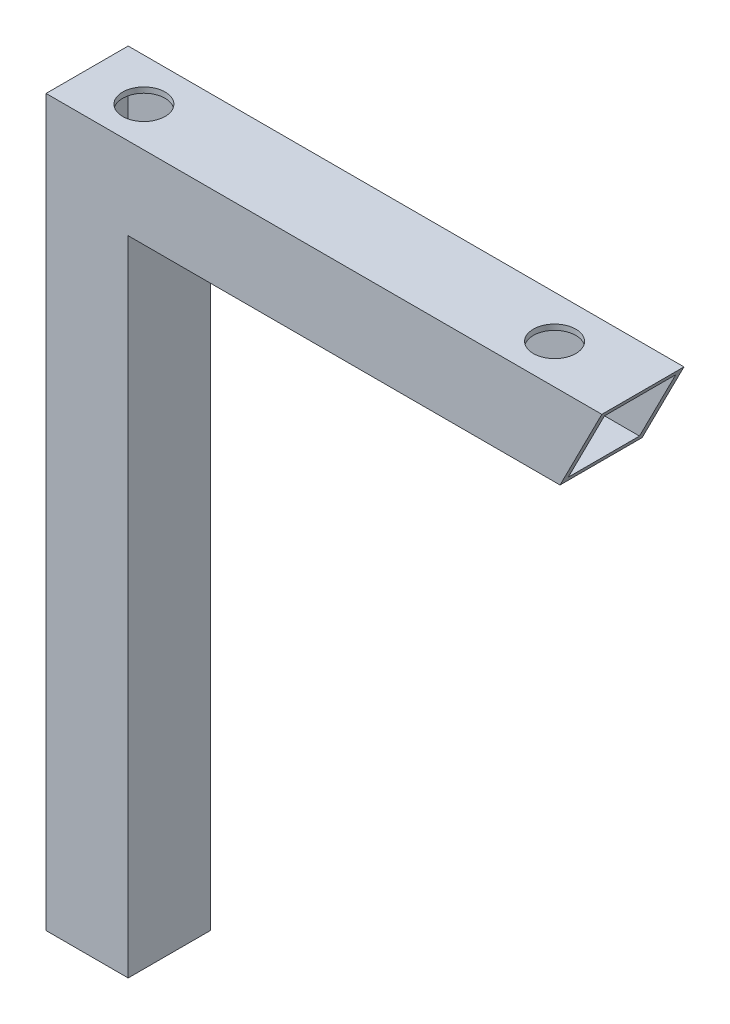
ISO-10303-21;
HEADER;
FILE_DESCRIPTION(('STEP AP214'),'2;1');
FILE_NAME('part.step','',(''),(''),'','','');
FILE_SCHEMA(('AUTOMOTIVE_DESIGN { 1 0 10303 214 1 1 1 1 }'));
ENDSEC;
DATA;
#1=APPLICATION_CONTEXT('core data for automotive mechanical design processes');
#2=APPLICATION_PROTOCOL_DEFINITION('international standard','automotive_design',2000,#1);
#3=PRODUCT_CONTEXT('',#1,'mechanical');
#4=PRODUCT('Part','Part','',(#3));
#5=PRODUCT_RELATED_PRODUCT_CATEGORY('part','',(#4));
#6=PRODUCT_DEFINITION_FORMATION('','',#4);
#7=PRODUCT_DEFINITION_CONTEXT('part definition',#1,'design');
#8=PRODUCT_DEFINITION('design','',#6,#7);
#9=PRODUCT_DEFINITION_SHAPE('','',#8);
#10=(LENGTH_UNIT() NAMED_UNIT(*) SI_UNIT(.MILLI.,.METRE.));
#11=(NAMED_UNIT(*) PLANE_ANGLE_UNIT() SI_UNIT($,.RADIAN.));
#12=(NAMED_UNIT(*) SI_UNIT($,.STERADIAN.) SOLID_ANGLE_UNIT());
#13=UNCERTAINTY_MEASURE_WITH_UNIT(LENGTH_MEASURE(1.E-05),#10,'distance_accuracy_value','');
#14=(GEOMETRIC_REPRESENTATION_CONTEXT(3) GLOBAL_UNCERTAINTY_ASSIGNED_CONTEXT((#13)) GLOBAL_UNIT_ASSIGNED_CONTEXT((#10,
#11,#12)) REPRESENTATION_CONTEXT('',''));
#15=CARTESIAN_POINT('',(0.,0.,0.));
#16=DIRECTION('',(0.,0.,1.));
#17=DIRECTION('',(1.,0.,0.));
#18=AXIS2_PLACEMENT_3D('',#15,#16,#17);
#19=CARTESIAN_POINT('',(12.7792611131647,-143.515804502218,30.));
#20=DIRECTION('',(-1.,0.,0.));
#21=DIRECTION('',(0.,0.,1.));
#22=AXIS2_PLACEMENT_3D('',#19,#20,#21);
#23=PLANE('',#22);
#24=DIRECTION('',(0.,1.,0.));
#25=VECTOR('',#24,1.);
#26=CARTESIAN_POINT('',(12.7792611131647,121.284195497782,19.4212184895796));
#27=LINE('',#26,#25);
#28=CARTESIAN_POINT('',(12.7792611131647,-143.515804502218,19.4212184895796));
#29=VERTEX_POINT('',#28);
#30=CARTESIAN_POINT('',(12.7792611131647,93.2841954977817,19.4212184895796));
#31=VERTEX_POINT('',#30);
#32=EDGE_CURVE('E56',#29,#31,#27,.T.);
#33=ORIENTED_EDGE('',*,*,#32,.F.);
#34=DIRECTION('',(0.,0.,1.));
#35=VECTOR('',#34,1.);
#36=CARTESIAN_POINT('',(12.7792611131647,-143.515804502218,28.));
#37=LINE('',#36,#35);
#38=CARTESIAN_POINT('',(12.7792611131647,-143.515804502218,28.));
#39=VERTEX_POINT('',#38);
#40=EDGE_CURVE('E63',#29,#39,#37,.T.);
#41=ORIENTED_EDGE('',*,*,#40,.T.);
#42=DIRECTION('',(0.,1.,0.));
#43=VECTOR('',#42,1.);
#44=CARTESIAN_POINT('',(12.7792611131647,-143.515804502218,28.));
#45=LINE('',#44,#43);
#46=CARTESIAN_POINT('',(12.7792611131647,93.2841954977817,28.));
#47=VERTEX_POINT('',#46);
#48=EDGE_CURVE('E177',#39,#47,#45,.T.);
#49=ORIENTED_EDGE('',*,*,#48,.T.);
#50=DIRECTION('',(0.,0.,-1.));
#51=VECTOR('',#50,1.);
#52=CARTESIAN_POINT('',(12.7792611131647,93.2841954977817,30.));
#53=LINE('',#52,#51);
#54=EDGE_CURVE('E151',#47,#31,#53,.T.);
#55=ORIENTED_EDGE('',*,*,#54,.T.);
#56=EDGE_LOOP('',(#33,#41,#49,#55));
#57=FACE_BOUND('',#56,.T.);
#58=ADVANCED_FACE('F41',(#57),#23,.T.);
#59=CARTESIAN_POINT('',(172.513278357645,91.2841954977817,30.));
#60=DIRECTION('',(-0.891244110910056,0.453523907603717,0.));
#61=DIRECTION('',(-0.453523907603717,-0.891244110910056,0.));
#62=AXIS2_PLACEMENT_3D('',#59,#60,#61);
#63=PLANE('',#62);
#64=DIRECTION('',(0.453523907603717,0.891244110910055,0.));
#65=VECTOR('',#64,1.);
#66=CARTESIAN_POINT('',(172.513278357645,91.2841954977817,0.));
#67=LINE('',#66,#65);
#68=CARTESIAN_POINT('',(172.513278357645,91.2841954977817,0.));
#69=VERTEX_POINT('',#68);
#70=CARTESIAN_POINT('',(187.779261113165,121.284195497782,0.));
#71=VERTEX_POINT('',#70);
#72=EDGE_CURVE('E230',#69,#71,#67,.T.);
#73=ORIENTED_EDGE('',*,*,#72,.T.);
#74=DIRECTION('',(0.,0.,-1.));
#75=VECTOR('',#74,1.);
#76=CARTESIAN_POINT('',(187.779261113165,121.284195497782,30.));
#77=LINE('',#76,#75);
#78=CARTESIAN_POINT('',(187.779261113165,121.284195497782,30.));
#79=VERTEX_POINT('',#78);
#80=EDGE_CURVE('E235',#79,#71,#77,.T.);
#81=ORIENTED_EDGE('',*,*,#80,.F.);
#82=DIRECTION('',(0.453523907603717,0.891244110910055,0.));
#83=VECTOR('',#82,1.);
#84=CARTESIAN_POINT('',(172.513278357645,91.2841954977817,30.));
#85=LINE('',#84,#83);
#86=CARTESIAN_POINT('',(172.513278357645,91.2841954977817,30.));
#87=VERTEX_POINT('',#86);
#88=EDGE_CURVE('E217',#87,#79,#85,.T.);
#89=ORIENTED_EDGE('',*,*,#88,.F.);
#90=DIRECTION('',(0.,0.,-1.));
#91=VECTOR('',#90,1.);
#92=CARTESIAN_POINT('',(172.513278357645,91.2841954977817,30.));
#93=LINE('',#92,#91);
#94=EDGE_CURVE('E238',#87,#69,#93,.T.);
#95=ORIENTED_EDGE('',*,*,#94,.T.);
#96=EDGE_LOOP('',(#73,#81,#89,#95));
#97=FACE_BOUND('',#96,.T.);
#98=DIRECTION('',(0.453523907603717,0.891244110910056,0.));
#99=VECTOR('',#98,1.);
#100=CARTESIAN_POINT('',(172.513278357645,91.2841954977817,2.));
#101=LINE('',#100,#99);
#102=CARTESIAN_POINT('',(173.531010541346,93.2841954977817,2.));
#103=VERTEX_POINT('',#102);
#104=CARTESIAN_POINT('',(186.761528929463,119.284195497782,2.));
#105=VERTEX_POINT('',#104);
#106=EDGE_CURVE('E193',#103,#105,#101,.T.);
#107=ORIENTED_EDGE('',*,*,#106,.F.);
#108=DIRECTION('',(0.,0.,-1.));
#109=VECTOR('',#108,1.);
#110=CARTESIAN_POINT('',(173.531010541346,93.2841954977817,30.));
#111=LINE('',#110,#109);
#112=CARTESIAN_POINT('',(173.531010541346,93.2841954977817,28.));
#113=VERTEX_POINT('',#112);
#114=EDGE_CURVE('E199',#113,#103,#111,.T.);
#115=ORIENTED_EDGE('',*,*,#114,.F.);
#116=DIRECTION('',(0.453523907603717,0.891244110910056,0.));
#117=VECTOR('',#116,1.);
#118=CARTESIAN_POINT('',(172.513278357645,91.2841954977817,28.));
#119=LINE('',#118,#117);
#120=CARTESIAN_POINT('',(186.761528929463,119.284195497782,28.));
#121=VERTEX_POINT('',#120);
#122=EDGE_CURVE('E196',#113,#121,#119,.T.);
#123=ORIENTED_EDGE('',*,*,#122,.T.);
#124=DIRECTION('',(0.,0.,-1.));
#125=VECTOR('',#124,1.);
#126=CARTESIAN_POINT('',(186.761528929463,119.284195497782,30.));
#127=LINE('',#126,#125);
#128=EDGE_CURVE('E182',#121,#105,#127,.T.);
#129=ORIENTED_EDGE('',*,*,#128,.T.);
#130=EDGE_LOOP('',(#107,#115,#123,#129));
#131=FACE_BOUND('',#130,.T.);
#132=ADVANCED_FACE('F276',(#97,#131),#63,.F.);
#133=CARTESIAN_POINT('',(-15.2207388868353,-143.515804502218,30.));
#134=DIRECTION('',(1.,0.,0.));
#135=DIRECTION('',(0.,1.,0.));
#136=AXIS2_PLACEMENT_3D('',#133,#134,#135);
#137=PLANE('',#136);
#138=DIRECTION('',(0.,-1.,0.));
#139=VECTOR('',#138,1.);
#140=CARTESIAN_POINT('',(-15.2207388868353,-143.515804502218,0.));
#141=LINE('',#140,#139);
#142=CARTESIAN_POINT('',(-15.2207388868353,121.284195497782,0.));
#143=VERTEX_POINT('',#142);
#144=CARTESIAN_POINT('',(-15.2207388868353,-143.515804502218,0.));
#145=VERTEX_POINT('',#144);
#146=EDGE_CURVE('E188',#143,#145,#141,.T.);
#147=ORIENTED_EDGE('',*,*,#146,.T.);
#148=DIRECTION('',(0.,0.,-1.));
#149=VECTOR('',#148,1.);
#150=CARTESIAN_POINT('',(-15.2207388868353,-143.515804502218,30.));
#151=LINE('',#150,#149);
#152=CARTESIAN_POINT('',(-15.2207388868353,-143.515804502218,30.));
#153=VERTEX_POINT('',#152);
#154=EDGE_CURVE('E50',#153,#145,#151,.T.);
#155=ORIENTED_EDGE('',*,*,#154,.F.);
#156=DIRECTION('',(0.,-1.,0.));
#157=VECTOR('',#156,1.);
#158=CARTESIAN_POINT('',(-15.2207388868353,-143.515804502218,30.));
#159=LINE('',#158,#157);
#160=CARTESIAN_POINT('',(-15.2207388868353,121.284195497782,30.));
#161=VERTEX_POINT('',#160);
#162=EDGE_CURVE('E207',#161,#153,#159,.T.);
#163=ORIENTED_EDGE('',*,*,#162,.F.);
#164=DIRECTION('',(0.,0.,-1.));
#165=VECTOR('',#164,1.);
#166=CARTESIAN_POINT('',(-15.2207388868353,121.284195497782,30.));
#167=LINE('',#166,#165);
#168=EDGE_CURVE('E221',#161,#143,#167,.T.);
#169=ORIENTED_EDGE('',*,*,#168,.T.);
#170=EDGE_LOOP('',(#147,#155,#163,#169));
#171=FACE_BOUND('',#170,.T.);
#172=ADVANCED_FACE('F43',(#171),#137,.F.);
#173=CARTESIAN_POINT('',(14.7792611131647,-143.515804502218,30.));
#174=DIRECTION('',(0.,1.,0.));
#175=DIRECTION('',(-1.,0.,0.));
#176=AXIS2_PLACEMENT_3D('',#173,#174,#175);
#177=PLANE('',#176);
#178=ORIENTED_EDGE('',*,*,#40,.F.);
#179=CARTESIAN_POINT('',(6.06926111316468,-143.515804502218,15.5432808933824));
#180=DIRECTION('',(0.,1.,0.));
#181=DIRECTION('',(0.,0.,1.));
#182=AXIS2_PLACEMENT_3D('',#179,#180,#181);
#183=CIRCLE('',#182,7.74999999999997);
#184=CARTESIAN_POINT('',(12.7792611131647,-143.515804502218,11.6653432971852));
#185=VERTEX_POINT('',#184);
#186=EDGE_CURVE('E140',#29,#185,#183,.T.);
#187=ORIENTED_EDGE('',*,*,#186,.T.);
#188=CARTESIAN_POINT('',(12.7792611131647,-143.515804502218,2.));
#189=VERTEX_POINT('',#188);
#190=EDGE_CURVE('E160',#189,#185,#37,.T.);
#191=ORIENTED_EDGE('',*,*,#190,.F.);
#192=DIRECTION('',(1.,0.,0.));
#193=VECTOR('',#192,1.);
#194=CARTESIAN_POINT('',(12.7792611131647,-143.515804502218,2.));
#195=LINE('',#194,#193);
#196=CARTESIAN_POINT('',(-13.2207388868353,-143.515804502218,1.99999999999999));
#197=VERTEX_POINT('',#196);
#198=EDGE_CURVE('E169',#197,#189,#195,.T.);
#199=ORIENTED_EDGE('',*,*,#198,.F.);
#200=DIRECTION('',(0.,0.,-1.));
#201=VECTOR('',#200,1.);
#202=CARTESIAN_POINT('',(-13.2207388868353,-143.515804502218,28.));
#203=LINE('',#202,#201);
#204=CARTESIAN_POINT('',(-13.2207388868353,-143.515804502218,28.));
#205=VERTEX_POINT('',#204);
#206=EDGE_CURVE('E166',#205,#197,#203,.T.);
#207=ORIENTED_EDGE('',*,*,#206,.F.);
#208=DIRECTION('',(-1.,0.,0.));
#209=VECTOR('',#208,1.);
#210=CARTESIAN_POINT('',(12.7792611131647,-143.515804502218,28.));
#211=LINE('',#210,#209);
#212=EDGE_CURVE('E159',#39,#205,#211,.T.);
#213=ORIENTED_EDGE('',*,*,#212,.F.);
#214=EDGE_LOOP('',(#178,#187,#191,#199,#207,#213));
#215=FACE_BOUND('',#214,.T.);
#216=DIRECTION('',(1.,0.,0.));
#217=VECTOR('',#216,1.);
#218=CARTESIAN_POINT('',(14.7792611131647,-143.515804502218,0.));
#219=LINE('',#218,#217);
#220=CARTESIAN_POINT('',(14.7792611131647,-143.515804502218,0.));
#221=VERTEX_POINT('',#220);
#222=EDGE_CURVE('E224',#145,#221,#219,.T.);
#223=ORIENTED_EDGE('',*,*,#222,.T.);
#224=DIRECTION('',(0.,0.,-1.));
#225=VECTOR('',#224,1.);
#226=CARTESIAN_POINT('',(14.7792611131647,-143.515804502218,30.));
#227=LINE('',#226,#225);
#228=CARTESIAN_POINT('',(14.7792611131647,-143.515804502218,30.));
#229=VERTEX_POINT('',#228);
#230=EDGE_CURVE('E244',#229,#221,#227,.T.);
#231=ORIENTED_EDGE('',*,*,#230,.F.);
#232=DIRECTION('',(1.,0.,0.));
#233=VECTOR('',#232,1.);
#234=CARTESIAN_POINT('',(14.7792611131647,-143.515804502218,30.));
#235=LINE('',#234,#233);
#236=EDGE_CURVE('E210',#153,#229,#235,.T.);
#237=ORIENTED_EDGE('',*,*,#236,.F.);
#238=ORIENTED_EDGE('',*,*,#154,.T.);
#239=EDGE_LOOP('',(#223,#231,#237,#238));
#240=FACE_BOUND('',#239,.T.);
#241=ADVANCED_FACE('F155',(#215,#240),#177,.F.);
#242=CARTESIAN_POINT('',(14.7792611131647,-143.515804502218,30.));
#243=DIRECTION('',(-1.,0.,0.));
#244=DIRECTION('',(0.,0.,1.));
#245=AXIS2_PLACEMENT_3D('',#242,#243,#244);
#246=PLANE('',#245);
#247=DIRECTION('',(0.,1.,0.));
#248=VECTOR('',#247,1.);
#249=CARTESIAN_POINT('',(14.7792611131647,-143.515804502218,0.));
#250=LINE('',#249,#248);
#251=CARTESIAN_POINT('',(14.7792611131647,91.2841954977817,0.));
#252=VERTEX_POINT('',#251);
#253=EDGE_CURVE('E226',#221,#252,#250,.T.);
#254=ORIENTED_EDGE('',*,*,#253,.T.);
#255=DIRECTION('',(0.,0.,-1.));
#256=VECTOR('',#255,1.);
#257=CARTESIAN_POINT('',(14.7792611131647,91.2841954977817,30.));
#258=LINE('',#257,#256);
#259=CARTESIAN_POINT('',(14.7792611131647,91.2841954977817,30.));
#260=VERTEX_POINT('',#259);
#261=EDGE_CURVE('E241',#260,#252,#258,.T.);
#262=ORIENTED_EDGE('',*,*,#261,.F.);
#263=DIRECTION('',(0.,1.,0.));
#264=VECTOR('',#263,1.);
#265=CARTESIAN_POINT('',(14.7792611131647,-143.515804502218,30.));
#266=LINE('',#265,#264);
#267=EDGE_CURVE('E213',#229,#260,#266,.T.);
#268=ORIENTED_EDGE('',*,*,#267,.F.);
#269=ORIENTED_EDGE('',*,*,#230,.T.);
#270=EDGE_LOOP('',(#254,#262,#268,#269));
#271=FACE_BOUND('',#270,.T.);
#272=ADVANCED_FACE('F262',(#271),#246,.F.);
#273=CARTESIAN_POINT('',(14.7792611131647,91.2841954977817,30.));
#274=DIRECTION('',(0.,1.,0.));
#275=DIRECTION('',(-1.,0.,0.));
#276=AXIS2_PLACEMENT_3D('',#273,#274,#275);
#277=PLANE('',#276);
#278=CARTESIAN_POINT('',(156.069261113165,91.2841954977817,15.5432808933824));
#279=DIRECTION('',(0.,1.,0.));
#280=DIRECTION('',(-1.,0.,0.));
#281=AXIS2_PLACEMENT_3D('',#278,#279,#280);
#282=CIRCLE('',#281,7.74999999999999);
#283=CARTESIAN_POINT('',(156.069261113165,91.2841954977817,23.2932808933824));
#284=VERTEX_POINT('',#283);
#285=EDGE_CURVE('E354',#284,#284,#282,.T.);
#286=ORIENTED_EDGE('',*,*,#285,.T.);
#287=EDGE_LOOP('',(#286));
#288=FACE_BOUND('',#287,.T.);
#289=DIRECTION('',(1.,0.,0.));
#290=VECTOR('',#289,1.);
#291=CARTESIAN_POINT('',(14.7792611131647,91.2841954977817,0.));
#292=LINE('',#291,#290);
#293=EDGE_CURVE('E228',#252,#69,#292,.T.);
#294=ORIENTED_EDGE('',*,*,#293,.T.);
#295=ORIENTED_EDGE('',*,*,#94,.F.);
#296=DIRECTION('',(1.,0.,0.));
#297=VECTOR('',#296,1.);
#298=CARTESIAN_POINT('',(14.7792611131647,91.2841954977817,30.));
#299=LINE('',#298,#297);
#300=EDGE_CURVE('E215',#260,#87,#299,.T.);
#301=ORIENTED_EDGE('',*,*,#300,.F.);
#302=ORIENTED_EDGE('',*,*,#261,.T.);
#303=EDGE_LOOP('',(#294,#295,#301,#302));
#304=FACE_BOUND('',#303,.T.);
#305=ADVANCED_FACE('F266',(#288,#304),#277,.F.);
#306=CARTESIAN_POINT('',(187.779261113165,121.284195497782,30.));
#307=DIRECTION('',(0.,-1.,0.));
#308=DIRECTION('',(1.,0.,0.));
#309=AXIS2_PLACEMENT_3D('',#306,#307,#308);
#310=PLANE('',#309);
#311=CARTESIAN_POINT('',(156.069261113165,121.284195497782,15.5432808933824));
#312=DIRECTION('',(0.,1.,0.));
#313=DIRECTION('',(0.,0.,1.));
#314=AXIS2_PLACEMENT_3D('',#311,#312,#313);
#315=CIRCLE('',#314,7.75000000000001);
#316=CARTESIAN_POINT('',(156.069261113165,121.284195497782,23.2932808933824));
#317=VERTEX_POINT('',#316);
#318=EDGE_CURVE('E347',#317,#317,#315,.T.);
#319=ORIENTED_EDGE('',*,*,#318,.F.);
#320=EDGE_LOOP('',(#319));
#321=FACE_BOUND('',#320,.T.);
#322=CARTESIAN_POINT('',(6.06926111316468,121.284195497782,15.5432808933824));
#323=DIRECTION('',(0.,1.,0.));
#324=DIRECTION('',(0.,0.,1.));
#325=AXIS2_PLACEMENT_3D('',#322,#323,#324);
#326=CIRCLE('',#325,7.75);
#327=CARTESIAN_POINT('',(6.06926111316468,121.284195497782,23.2932808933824));
#328=VERTEX_POINT('',#327);
#329=EDGE_CURVE('E147',#328,#328,#326,.T.);
#330=ORIENTED_EDGE('',*,*,#329,.F.);
#331=EDGE_LOOP('',(#330));
#332=FACE_BOUND('',#331,.T.);
#333=DIRECTION('',(-1.,0.,0.));
#334=VECTOR('',#333,1.);
#335=CARTESIAN_POINT('',(187.779261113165,121.284195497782,0.));
#336=LINE('',#335,#334);
#337=EDGE_CURVE('E211',#71,#143,#336,.T.);
#338=ORIENTED_EDGE('',*,*,#337,.T.);
#339=ORIENTED_EDGE('',*,*,#168,.F.);
#340=DIRECTION('',(-1.,0.,0.));
#341=VECTOR('',#340,1.);
#342=CARTESIAN_POINT('',(187.779261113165,121.284195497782,30.));
#343=LINE('',#342,#341);
#344=EDGE_CURVE('E219',#79,#161,#343,.T.);
#345=ORIENTED_EDGE('',*,*,#344,.F.);
#346=ORIENTED_EDGE('',*,*,#80,.T.);
#347=EDGE_LOOP('',(#338,#339,#345,#346));
#348=FACE_BOUND('',#347,.T.);
#349=ADVANCED_FACE('F274',(#321,#332,#348),#310,.F.);
#350=CARTESIAN_POINT('',(0.,0.,30.));
#351=DIRECTION('',(0.,0.,1.));
#352=DIRECTION('',(1.,0.,0.));
#353=AXIS2_PLACEMENT_3D('',#350,#351,#352);
#354=PLANE('',#353);
#355=ORIENTED_EDGE('',*,*,#162,.T.);
#356=ORIENTED_EDGE('',*,*,#236,.T.);
#357=ORIENTED_EDGE('',*,*,#267,.T.);
#358=ORIENTED_EDGE('',*,*,#300,.T.);
#359=ORIENTED_EDGE('',*,*,#88,.T.);
#360=ORIENTED_EDGE('',*,*,#344,.T.);
#361=EDGE_LOOP('',(#355,#356,#357,#358,#359,#360));
#362=FACE_BOUND('',#361,.T.);
#363=ADVANCED_FACE('F270',(#362),#354,.T.);
#364=CARTESIAN_POINT('',(0.,0.,0.));
#365=DIRECTION('',(0.,0.,1.));
#366=DIRECTION('',(1.,0.,0.));
#367=AXIS2_PLACEMENT_3D('',#364,#365,#366);
#368=PLANE('',#367);
#369=ORIENTED_EDGE('',*,*,#146,.F.);
#370=ORIENTED_EDGE('',*,*,#337,.F.);
#371=ORIENTED_EDGE('',*,*,#72,.F.);
#372=ORIENTED_EDGE('',*,*,#293,.F.);
#373=ORIENTED_EDGE('',*,*,#253,.F.);
#374=ORIENTED_EDGE('',*,*,#222,.F.);
#375=EDGE_LOOP('',(#369,#370,#371,#372,#373,#374));
#376=FACE_BOUND('',#375,.T.);
#377=ADVANCED_FACE('F256',(#376),#368,.F.);
#378=CARTESIAN_POINT('',(-13.2207388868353,-143.515804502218,30.));
#379=DIRECTION('',(1.,0.,0.));
#380=DIRECTION('',(0.,1.,0.));
#381=AXIS2_PLACEMENT_3D('',#378,#379,#380);
#382=PLANE('',#381);
#383=DIRECTION('',(0.,-1.,0.));
#384=VECTOR('',#383,1.);
#385=CARTESIAN_POINT('',(-13.2207388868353,-143.515804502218,28.));
#386=LINE('',#385,#384);
#387=CARTESIAN_POINT('',(-13.2207388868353,119.284195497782,28.));
#388=VERTEX_POINT('',#387);
#389=EDGE_CURVE('E175',#388,#205,#386,.T.);
#390=ORIENTED_EDGE('',*,*,#389,.T.);
#391=ORIENTED_EDGE('',*,*,#206,.T.);
#392=DIRECTION('',(0.,-1.,0.));
#393=VECTOR('',#392,1.);
#394=CARTESIAN_POINT('',(-13.2207388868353,-143.515804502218,2.));
#395=LINE('',#394,#393);
#396=CARTESIAN_POINT('',(-13.2207388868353,119.284195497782,2.));
#397=VERTEX_POINT('',#396);
#398=EDGE_CURVE('E172',#397,#197,#395,.T.);
#399=ORIENTED_EDGE('',*,*,#398,.F.);
#400=DIRECTION('',(0.,0.,-1.));
#401=VECTOR('',#400,1.);
#402=CARTESIAN_POINT('',(-13.2207388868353,119.284195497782,30.));
#403=LINE('',#402,#401);
#404=EDGE_CURVE('E179',#388,#397,#403,.T.);
#405=ORIENTED_EDGE('',*,*,#404,.F.);
#406=EDGE_LOOP('',(#390,#391,#399,#405));
#407=FACE_BOUND('',#406,.T.);
#408=ADVANCED_FACE('F293',(#407),#382,.T.);
#409=DIRECTION('',(0.,1.,0.));
#410=VECTOR('',#409,1.);
#411=CARTESIAN_POINT('',(12.7792611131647,121.284195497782,11.6653432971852));
#412=LINE('',#411,#410);
#413=CARTESIAN_POINT('',(12.7792611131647,93.2841954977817,11.6653432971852));
#414=VERTEX_POINT('',#413);
#415=EDGE_CURVE('E143',#414,#185,#412,.F.);
#416=ORIENTED_EDGE('',*,*,#415,.F.);
#417=CARTESIAN_POINT('',(12.7792611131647,93.2841954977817,2.));
#418=VERTEX_POINT('',#417);
#419=EDGE_CURVE('E189',#414,#418,#53,.T.);
#420=ORIENTED_EDGE('',*,*,#419,.T.);
#421=DIRECTION('',(0.,1.,0.));
#422=VECTOR('',#421,1.);
#423=CARTESIAN_POINT('',(12.7792611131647,-143.515804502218,2.));
#424=LINE('',#423,#422);
#425=EDGE_CURVE('E174',#189,#418,#424,.T.);
#426=ORIENTED_EDGE('',*,*,#425,.F.);
#427=ORIENTED_EDGE('',*,*,#190,.T.);
#428=EDGE_LOOP('',(#416,#420,#426,#427));
#429=FACE_BOUND('',#428,.T.);
#430=ADVANCED_FACE('F296',(#429),#23,.T.);
#431=CARTESIAN_POINT('',(14.7792611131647,93.2841954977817,30.));
#432=DIRECTION('',(0.,1.,0.));
#433=DIRECTION('',(-1.,0.,0.));
#434=AXIS2_PLACEMENT_3D('',#431,#432,#433);
#435=PLANE('',#434);
#436=CARTESIAN_POINT('',(156.069261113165,93.2841954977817,15.5432808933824));
#437=DIRECTION('',(0.,1.,0.));
#438=DIRECTION('',(-1.,0.,0.));
#439=AXIS2_PLACEMENT_3D('',#436,#437,#438);
#440=CIRCLE('',#439,7.74999999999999);
#441=CARTESIAN_POINT('',(156.069261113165,93.2841954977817,23.2932808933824));
#442=VERTEX_POINT('',#441);
#443=EDGE_CURVE('E350',#442,#442,#440,.T.);
#444=ORIENTED_EDGE('',*,*,#443,.F.);
#445=EDGE_LOOP('',(#444));
#446=FACE_BOUND('',#445,.T.);
#447=CARTESIAN_POINT('',(6.06926111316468,93.2841954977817,15.5432808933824));
#448=DIRECTION('',(0.,1.,0.));
#449=DIRECTION('',(-1.,0.,0.));
#450=AXIS2_PLACEMENT_3D('',#447,#448,#449);
#451=CIRCLE('',#450,7.74999999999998);
#452=EDGE_CURVE('E11',#31,#414,#451,.T.);
#453=ORIENTED_EDGE('',*,*,#452,.F.);
#454=ORIENTED_EDGE('',*,*,#54,.F.);
#455=DIRECTION('',(1.,0.,0.));
#456=VECTOR('',#455,1.);
#457=CARTESIAN_POINT('',(14.7792611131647,93.2841954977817,28.));
#458=LINE('',#457,#456);
#459=EDGE_CURVE('E191',#47,#113,#458,.T.);
#460=ORIENTED_EDGE('',*,*,#459,.T.);
#461=ORIENTED_EDGE('',*,*,#114,.T.);
#462=DIRECTION('',(1.,0.,0.));
#463=VECTOR('',#462,1.);
#464=CARTESIAN_POINT('',(14.7792611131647,93.2841954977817,2.));
#465=LINE('',#464,#463);
#466=EDGE_CURVE('E186',#418,#103,#465,.T.);
#467=ORIENTED_EDGE('',*,*,#466,.F.);
#468=ORIENTED_EDGE('',*,*,#419,.F.);
#469=EDGE_LOOP('',(#453,#454,#460,#461,#467,#468));
#470=FACE_BOUND('',#469,.T.);
#471=ADVANCED_FACE('F299',(#446,#470),#435,.T.);
#472=CARTESIAN_POINT('',(187.779261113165,119.284195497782,30.));
#473=DIRECTION('',(0.,-1.,0.));
#474=DIRECTION('',(1.,0.,0.));
#475=AXIS2_PLACEMENT_3D('',#472,#473,#474);
#476=PLANE('',#475);
#477=CARTESIAN_POINT('',(156.069261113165,119.284195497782,15.5432808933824));
#478=DIRECTION('',(0.,-1.,0.));
#479=DIRECTION('',(1.,0.,0.));
#480=AXIS2_PLACEMENT_3D('',#477,#478,#479);
#481=CIRCLE('',#480,7.74999999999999);
#482=CARTESIAN_POINT('',(163.819261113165,119.284195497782,15.5432808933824));
#483=VERTEX_POINT('',#482);
#484=EDGE_CURVE('E45',#483,#483,#481,.T.);
#485=ORIENTED_EDGE('',*,*,#484,.F.);
#486=EDGE_LOOP('',(#485));
#487=FACE_BOUND('',#486,.T.);
#488=CARTESIAN_POINT('',(6.06926111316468,119.284195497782,15.5432808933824));
#489=DIRECTION('',(0.,-1.,0.));
#490=DIRECTION('',(1.,0.,0.));
#491=AXIS2_PLACEMENT_3D('',#488,#489,#490);
#492=CIRCLE('',#491,7.74999999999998);
#493=CARTESIAN_POINT('',(13.8192611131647,119.284195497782,15.5432808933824));
#494=VERTEX_POINT('',#493);
#495=EDGE_CURVE('E152',#494,#494,#492,.T.);
#496=ORIENTED_EDGE('',*,*,#495,.F.);
#497=EDGE_LOOP('',(#496));
#498=FACE_BOUND('',#497,.T.);
#499=DIRECTION('',(-1.,0.,0.));
#500=VECTOR('',#499,1.);
#501=CARTESIAN_POINT('',(187.779261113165,119.284195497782,2.));
#502=LINE('',#501,#500);
#503=EDGE_CURVE('E178',#105,#397,#502,.T.);
#504=ORIENTED_EDGE('',*,*,#503,.F.);
#505=ORIENTED_EDGE('',*,*,#128,.F.);
#506=DIRECTION('',(-1.,0.,0.));
#507=VECTOR('',#506,1.);
#508=CARTESIAN_POINT('',(187.779261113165,119.284195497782,28.));
#509=LINE('',#508,#507);
#510=EDGE_CURVE('E183',#121,#388,#509,.T.);
#511=ORIENTED_EDGE('',*,*,#510,.T.);
#512=ORIENTED_EDGE('',*,*,#404,.T.);
#513=EDGE_LOOP('',(#504,#505,#511,#512));
#514=FACE_BOUND('',#513,.T.);
#515=ADVANCED_FACE('F287',(#487,#498,#514),#476,.T.);
#516=CARTESIAN_POINT('',(0.,0.,28.));
#517=DIRECTION('',(0.,0.,1.));
#518=DIRECTION('',(1.,0.,0.));
#519=AXIS2_PLACEMENT_3D('',#516,#517,#518);
#520=PLANE('',#519);
#521=ORIENTED_EDGE('',*,*,#459,.F.);
#522=ORIENTED_EDGE('',*,*,#48,.F.);
#523=ORIENTED_EDGE('',*,*,#212,.T.);
#524=ORIENTED_EDGE('',*,*,#389,.F.);
#525=ORIENTED_EDGE('',*,*,#510,.F.);
#526=ORIENTED_EDGE('',*,*,#122,.F.);
#527=EDGE_LOOP('',(#521,#522,#523,#524,#525,#526));
#528=FACE_BOUND('',#527,.T.);
#529=ADVANCED_FACE('F302',(#528),#520,.F.);
#530=CARTESIAN_POINT('',(0.,0.,2.));
#531=DIRECTION('',(0.,0.,1.));
#532=DIRECTION('',(1.,0.,0.));
#533=AXIS2_PLACEMENT_3D('',#530,#531,#532);
#534=PLANE('',#533);
#535=ORIENTED_EDGE('',*,*,#398,.T.);
#536=ORIENTED_EDGE('',*,*,#198,.T.);
#537=ORIENTED_EDGE('',*,*,#425,.T.);
#538=ORIENTED_EDGE('',*,*,#466,.T.);
#539=ORIENTED_EDGE('',*,*,#106,.T.);
#540=ORIENTED_EDGE('',*,*,#503,.T.);
#541=EDGE_LOOP('',(#535,#536,#537,#538,#539,#540));
#542=FACE_BOUND('',#541,.T.);
#543=ADVANCED_FACE('F284',(#542),#534,.T.);
#544=CARTESIAN_POINT('',(6.06926111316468,121.284195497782,15.5432808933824));
#545=DIRECTION('',(0.,1.,0.));
#546=DIRECTION('',(0.,0.,1.));
#547=AXIS2_PLACEMENT_3D('',#544,#545,#546);
#548=CYLINDRICAL_SURFACE('',#547,7.74999999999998);
#549=ORIENTED_EDGE('',*,*,#32,.T.);
#550=ORIENTED_EDGE('',*,*,#452,.T.);
#551=ORIENTED_EDGE('',*,*,#415,.T.);
#552=ORIENTED_EDGE('',*,*,#186,.F.);
#553=EDGE_LOOP('',(#549,#550,#551,#552));
#554=FACE_BOUND('',#553,.T.);
#555=ADVANCED_FACE('F141',(#554),#548,.F.);
#556=ORIENTED_EDGE('',*,*,#495,.T.);
#557=EDGE_LOOP('',(#556));
#558=FACE_BOUND('',#557,.T.);
#559=ORIENTED_EDGE('',*,*,#329,.T.);
#560=EDGE_LOOP('',(#559));
#561=FACE_BOUND('',#560,.T.);
#562=ADVANCED_FACE('F331',(#558,#561),#548,.F.);
#563=CARTESIAN_POINT('',(156.069261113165,121.284195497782,15.5432808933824));
#564=DIRECTION('',(0.,1.,0.));
#565=DIRECTION('',(0.,0.,1.));
#566=AXIS2_PLACEMENT_3D('',#563,#564,#565);
#567=CYLINDRICAL_SURFACE('',#566,7.74999999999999);
#568=ORIENTED_EDGE('',*,*,#484,.T.);
#569=EDGE_LOOP('',(#568));
#570=FACE_BOUND('',#569,.T.);
#571=ORIENTED_EDGE('',*,*,#318,.T.);
#572=EDGE_LOOP('',(#571));
#573=FACE_BOUND('',#572,.T.);
#574=ADVANCED_FACE('F332',(#570,#573),#567,.F.);
#575=CARTESIAN_POINT('',(156.069261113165,93.2841954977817,23.2932808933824));
#576=CARTESIAN_POINT('',(156.069261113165,93.2633621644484,23.2932808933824));
#577=CARTESIAN_POINT('',(156.069261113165,93.2425288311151,23.2932808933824));
#578=CARTESIAN_POINT('',(156.069261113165,93.2008621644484,23.2932808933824));
#579=CARTESIAN_POINT('',(156.069261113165,93.1800288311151,23.2932808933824));
#580=CARTESIAN_POINT('',(156.069261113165,93.1383621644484,23.2932808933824));
#581=CARTESIAN_POINT('',(156.069261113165,93.1175288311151,23.2932808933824));
#582=CARTESIAN_POINT('',(156.069261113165,93.0758621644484,23.2932808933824));
#583=CARTESIAN_POINT('',(156.069261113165,93.0550288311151,23.2932808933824));
#584=CARTESIAN_POINT('',(156.069261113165,93.0133621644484,23.2932808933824));
#585=CARTESIAN_POINT('',(156.069261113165,92.9925288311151,23.2932808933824));
#586=CARTESIAN_POINT('',(156.069261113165,92.9508621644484,23.2932808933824));
#587=CARTESIAN_POINT('',(156.069261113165,92.9300288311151,23.2932808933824));
#588=CARTESIAN_POINT('',(156.069261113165,92.8883621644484,23.2932808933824));
#589=CARTESIAN_POINT('',(156.069261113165,92.8675288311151,23.2932808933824));
#590=CARTESIAN_POINT('',(156.069261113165,92.8258621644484,23.2932808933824));
#591=CARTESIAN_POINT('',(156.069261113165,92.8050288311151,23.2932808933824));
#592=CARTESIAN_POINT('',(156.069261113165,92.7633621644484,23.2932808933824));
#593=CARTESIAN_POINT('',(156.069261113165,92.7425288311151,23.2932808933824));
#594=CARTESIAN_POINT('',(156.069261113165,92.7008621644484,23.2932808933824));
#595=CARTESIAN_POINT('',(156.069261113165,92.6800288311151,23.2932808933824));
#596=CARTESIAN_POINT('',(156.069261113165,92.6383621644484,23.2932808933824));
#597=CARTESIAN_POINT('',(156.069261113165,92.6175288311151,23.2932808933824));
#598=CARTESIAN_POINT('',(156.069261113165,92.5758621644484,23.2932808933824));
#599=CARTESIAN_POINT('',(156.069261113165,92.5550288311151,23.2932808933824));
#600=CARTESIAN_POINT('',(156.069261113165,92.5133621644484,23.2932808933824));
#601=CARTESIAN_POINT('',(156.069261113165,92.4925288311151,23.2932808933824));
#602=CARTESIAN_POINT('',(156.069261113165,92.4508621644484,23.2932808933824));
#603=CARTESIAN_POINT('',(156.069261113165,92.4300288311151,23.2932808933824));
#604=CARTESIAN_POINT('',(156.069261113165,92.3883621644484,23.2932808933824));
#605=CARTESIAN_POINT('',(156.069261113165,92.3675288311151,23.2932808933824));
#606=CARTESIAN_POINT('',(156.069261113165,92.3258621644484,23.2932808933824));
#607=CARTESIAN_POINT('',(156.069261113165,92.3050288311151,23.2932808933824));
#608=CARTESIAN_POINT('',(156.069261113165,92.2633621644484,23.2932808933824));
#609=CARTESIAN_POINT('',(156.069261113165,92.2425288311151,23.2932808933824));
#610=CARTESIAN_POINT('',(156.069261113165,92.2008621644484,23.2932808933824));
#611=CARTESIAN_POINT('',(156.069261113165,92.1800288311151,23.2932808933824));
#612=CARTESIAN_POINT('',(156.069261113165,92.1383621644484,23.2932808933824));
#613=CARTESIAN_POINT('',(156.069261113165,92.1175288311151,23.2932808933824));
#614=CARTESIAN_POINT('',(156.069261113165,92.0758621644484,23.2932808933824));
#615=CARTESIAN_POINT('',(156.069261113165,92.0550288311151,23.2932808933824));
#616=CARTESIAN_POINT('',(156.069261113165,92.0133621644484,23.2932808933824));
#617=CARTESIAN_POINT('',(156.069261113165,91.9925288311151,23.2932808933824));
#618=CARTESIAN_POINT('',(156.069261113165,91.9508621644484,23.2932808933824));
#619=CARTESIAN_POINT('',(156.069261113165,91.9300288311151,23.2932808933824));
#620=CARTESIAN_POINT('',(156.069261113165,91.8883621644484,23.2932808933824));
#621=CARTESIAN_POINT('',(156.069261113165,91.8675288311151,23.2932808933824));
#622=CARTESIAN_POINT('',(156.069261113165,91.8258621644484,23.2932808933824));
#623=CARTESIAN_POINT('',(156.069261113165,91.8050288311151,23.2932808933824));
#624=CARTESIAN_POINT('',(156.069261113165,91.7633621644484,23.2932808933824));
#625=CARTESIAN_POINT('',(156.069261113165,91.7425288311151,23.2932808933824));
#626=CARTESIAN_POINT('',(156.069261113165,91.7008621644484,23.2932808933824));
#627=CARTESIAN_POINT('',(156.069261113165,91.6800288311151,23.2932808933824));
#628=CARTESIAN_POINT('',(156.069261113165,91.6383621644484,23.2932808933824));
#629=CARTESIAN_POINT('',(156.069261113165,91.6175288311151,23.2932808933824));
#630=CARTESIAN_POINT('',(156.069261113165,91.5758621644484,23.2932808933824));
#631=CARTESIAN_POINT('',(156.069261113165,91.5550288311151,23.2932808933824));
#632=CARTESIAN_POINT('',(156.069261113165,91.5133621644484,23.2932808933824));
#633=CARTESIAN_POINT('',(156.069261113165,91.4925288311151,23.2932808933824));
#634=CARTESIAN_POINT('',(156.069261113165,91.4508621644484,23.2932808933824));
#635=CARTESIAN_POINT('',(156.069261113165,91.4300288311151,23.2932808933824));
#636=CARTESIAN_POINT('',(156.069261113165,91.3883621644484,23.2932808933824));
#637=CARTESIAN_POINT('',(156.069261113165,91.3675288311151,23.2932808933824));
#638=CARTESIAN_POINT('',(156.069261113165,91.3258621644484,23.2932808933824));
#639=CARTESIAN_POINT('',(156.069261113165,91.3050288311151,23.2932808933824));
#640=CARTESIAN_POINT('',(156.069261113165,91.2841954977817,23.2932808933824));
#641=B_SPLINE_CURVE_WITH_KNOTS('',3,(#575,#576,#577,#578,#579,#580,#581,#582,#583,#584,#585,
#586,#587,#588,#589,#590,#591,#592,#593,#594,#595,#596,#597,#598,#599,#600,#601,#602,#603,#604,
#605,#606,#607,#608,#609,#610,#611,#612,#613,#614,#615,#616,#617,#618,#619,#620,#621,#622,#623,
#624,#625,#626,#627,#628,#629,#630,#631,#632,#633,#634,#635,#636,#637,#638,#639,#640),
.UNSPECIFIED.,.F.,.F.,(4,2,2,2,2,2,2,2,2,2,2,2,2,2,2,2,2,2,2,2,2,2,2,2,2,2,2,2,2,2,2,2,4),(0.,
0.0624999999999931,0.124999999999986,0.187499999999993,0.25,0.312499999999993,0.374999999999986,
0.437499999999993,0.5,0.562499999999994,0.624999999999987,0.687499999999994,0.750000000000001,
0.812499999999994,0.874999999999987,0.937499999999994,1.,1.06249999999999,1.12499999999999,
1.18749999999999,1.25,1.31249999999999,1.37499999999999,1.43749999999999,1.5,1.56249999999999,
1.62499999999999,1.68749999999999,1.75,1.81249999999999,1.87499999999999,1.93749999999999,2.),.UNSPECIFIED.);
#642=EDGE_CURVE('BSEAM334',#442,#284,#641,.T.);
#643=ORIENTED_EDGE('',*,*,#443,.T.);
#644=ORIENTED_EDGE('',*,*,#285,.F.);
#645=ORIENTED_EDGE('',*,*,#642,.T.);
#646=ORIENTED_EDGE('',*,*,#642,.F.);
#647=EDGE_LOOP('',(#643,#645,#644,#646));
#648=FACE_BOUND('',#647,.T.);
#649=ADVANCED_FACE('F334',(#648),#567,.F.);
#650=CLOSED_SHELL('',(#58,#132,#172,#241,#272,#305,#349,#363,#377,#408,#430,#471,#515,#529,#543,
#555,#562,#574,#649));
#651=MANIFOLD_SOLID_BREP('B2',#650);
#652=ADVANCED_BREP_SHAPE_REPRESENTATION('',(#18,#651),#14);
#653=SHAPE_DEFINITION_REPRESENTATION(#9,#652);
ENDSEC;
END-ISO-10303-21;
